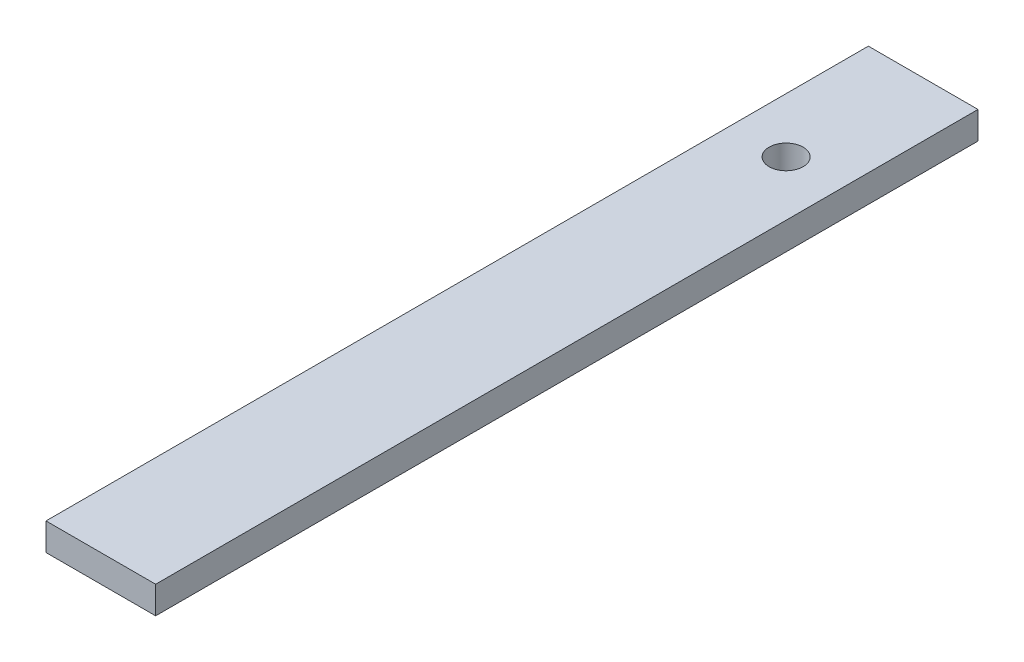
ISO-10303-21;
HEADER;
FILE_DESCRIPTION(('STEP AP214'),'2;1');
FILE_NAME('part.step','',(''),(''),'','','');
FILE_SCHEMA(('AUTOMOTIVE_DESIGN { 1 0 10303 214 1 1 1 1 }'));
ENDSEC;
DATA;
#1=APPLICATION_CONTEXT('core data for automotive mechanical design processes');
#2=APPLICATION_PROTOCOL_DEFINITION('international standard','automotive_design',2000,#1);
#3=PRODUCT_CONTEXT('',#1,'mechanical');
#4=PRODUCT('Part','Part','',(#3));
#5=PRODUCT_RELATED_PRODUCT_CATEGORY('part','',(#4));
#6=PRODUCT_DEFINITION_FORMATION('','',#4);
#7=PRODUCT_DEFINITION_CONTEXT('part definition',#1,'design');
#8=PRODUCT_DEFINITION('design','',#6,#7);
#9=PRODUCT_DEFINITION_SHAPE('','',#8);
#10=(LENGTH_UNIT() NAMED_UNIT(*) SI_UNIT(.MILLI.,.METRE.));
#11=(NAMED_UNIT(*) PLANE_ANGLE_UNIT() SI_UNIT($,.RADIAN.));
#12=(NAMED_UNIT(*) SI_UNIT($,.STERADIAN.) SOLID_ANGLE_UNIT());
#13=UNCERTAINTY_MEASURE_WITH_UNIT(LENGTH_MEASURE(1.E-05),#10,'distance_accuracy_value','');
#14=(GEOMETRIC_REPRESENTATION_CONTEXT(3) GLOBAL_UNCERTAINTY_ASSIGNED_CONTEXT((#13)) GLOBAL_UNIT_ASSIGNED_CONTEXT((#10,
#11,#12)) REPRESENTATION_CONTEXT('',''));
#15=CARTESIAN_POINT('',(0.,0.,0.));
#16=DIRECTION('',(0.,0.,1.));
#17=DIRECTION('',(1.,0.,0.));
#18=AXIS2_PLACEMENT_3D('',#15,#16,#17);
#19=CARTESIAN_POINT('',(0.,12.7,0.));
#20=DIRECTION('',(0.,-1.,0.));
#21=DIRECTION('',(0.,0.,-1.));
#22=AXIS2_PLACEMENT_3D('',#19,#20,#21);
#23=PLANE('',#22);
#24=DIRECTION('',(0.,0.,1.));
#25=VECTOR('',#24,1.);
#26=CARTESIAN_POINT('',(0.,12.7,0.));
#27=LINE('',#26,#25);
#28=CARTESIAN_POINT('',(0.,12.7,-381.));
#29=VERTEX_POINT('',#28);
#30=CARTESIAN_POINT('',(0.,12.7,0.));
#31=VERTEX_POINT('',#30);
#32=EDGE_CURVE('E85',#29,#31,#27,.T.);
#33=ORIENTED_EDGE('',*,*,#32,.T.);
#34=DIRECTION('',(1.,0.,0.));
#35=VECTOR('',#34,1.);
#36=CARTESIAN_POINT('',(0.,12.7,0.));
#37=LINE('',#36,#35);
#38=CARTESIAN_POINT('',(50.8,12.7,0.));
#39=VERTEX_POINT('',#38);
#40=EDGE_CURVE('E80',#31,#39,#37,.T.);
#41=ORIENTED_EDGE('',*,*,#40,.T.);
#42=DIRECTION('',(0.,0.,-1.));
#43=VECTOR('',#42,1.);
#44=CARTESIAN_POINT('',(50.8,12.7,0.));
#45=LINE('',#44,#43);
#46=CARTESIAN_POINT('',(50.7999999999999,12.7,-381.));
#47=VERTEX_POINT('',#46);
#48=EDGE_CURVE('E83',#39,#47,#45,.T.);
#49=ORIENTED_EDGE('',*,*,#48,.T.);
#50=DIRECTION('',(-1.,0.,0.));
#51=VECTOR('',#50,1.);
#52=CARTESIAN_POINT('',(0.,12.7,-381.));
#53=LINE('',#52,#51);
#54=EDGE_CURVE('E50',#47,#29,#53,.T.);
#55=ORIENTED_EDGE('',*,*,#54,.T.);
#56=EDGE_LOOP('',(#33,#41,#49,#55));
#57=FACE_BOUND('',#56,.T.);
#58=CARTESIAN_POINT('',(25.4,12.7,-317.5));
#59=DIRECTION('',(0.,1.,0.));
#60=DIRECTION('',(0.,0.,1.));
#61=AXIS2_PLACEMENT_3D('',#58,#59,#60);
#62=CIRCLE('',#61,7.87400000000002);
#63=CARTESIAN_POINT('',(25.4,12.7,-309.626));
#64=VERTEX_POINT('',#63);
#65=EDGE_CURVE('E100',#64,#64,#62,.T.);
#66=ORIENTED_EDGE('',*,*,#65,.F.);
#67=EDGE_LOOP('',(#66));
#68=FACE_BOUND('',#67,.T.);
#69=ADVANCED_FACE('F33',(#57,#68),#23,.F.);
#70=CARTESIAN_POINT('',(0.,0.,0.));
#71=DIRECTION('',(0.,-1.,0.));
#72=DIRECTION('',(0.,0.,-1.));
#73=AXIS2_PLACEMENT_3D('',#70,#71,#72);
#74=PLANE('',#73);
#75=DIRECTION('',(0.,0.,1.));
#76=VECTOR('',#75,1.);
#77=CARTESIAN_POINT('',(0.,0.,0.));
#78=LINE('',#77,#76);
#79=CARTESIAN_POINT('',(0.,0.,-381.));
#80=VERTEX_POINT('',#79);
#81=CARTESIAN_POINT('',(0.,0.,0.));
#82=VERTEX_POINT('',#81);
#83=EDGE_CURVE('E97',#80,#82,#78,.T.);
#84=ORIENTED_EDGE('',*,*,#83,.F.);
#85=DIRECTION('',(-1.,0.,0.));
#86=VECTOR('',#85,1.);
#87=CARTESIAN_POINT('',(0.,0.,-381.));
#88=LINE('',#87,#86);
#89=CARTESIAN_POINT('',(50.7999999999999,0.,-381.));
#90=VERTEX_POINT('',#89);
#91=EDGE_CURVE('E73',#90,#80,#88,.T.);
#92=ORIENTED_EDGE('',*,*,#91,.F.);
#93=DIRECTION('',(0.,0.,-1.));
#94=VECTOR('',#93,1.);
#95=CARTESIAN_POINT('',(50.8,0.,0.));
#96=LINE('',#95,#94);
#97=CARTESIAN_POINT('',(50.8,0.,0.));
#98=VERTEX_POINT('',#97);
#99=EDGE_CURVE('E67',#98,#90,#96,.T.);
#100=ORIENTED_EDGE('',*,*,#99,.F.);
#101=DIRECTION('',(1.,0.,0.));
#102=VECTOR('',#101,1.);
#103=CARTESIAN_POINT('',(0.,0.,0.));
#104=LINE('',#103,#102);
#105=EDGE_CURVE('E89',#82,#98,#104,.T.);
#106=ORIENTED_EDGE('',*,*,#105,.F.);
#107=EDGE_LOOP('',(#84,#92,#100,#106));
#108=FACE_BOUND('',#107,.T.);
#109=CARTESIAN_POINT('',(25.4,0.,-317.5));
#110=DIRECTION('',(0.,1.,0.));
#111=DIRECTION('',(0.,0.,1.));
#112=AXIS2_PLACEMENT_3D('',#109,#110,#111);
#113=CIRCLE('',#112,7.87400000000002);
#114=CARTESIAN_POINT('',(25.4,0.,-309.626));
#115=VERTEX_POINT('',#114);
#116=EDGE_CURVE('E112',#115,#115,#113,.T.);
#117=ORIENTED_EDGE('',*,*,#116,.T.);
#118=EDGE_LOOP('',(#117));
#119=FACE_BOUND('',#118,.T.);
#120=ADVANCED_FACE('F108',(#108,#119),#74,.T.);
#121=CARTESIAN_POINT('',(0.,12.7,0.));
#122=DIRECTION('',(1.,0.,0.));
#123=DIRECTION('',(0.,0.,-1.));
#124=AXIS2_PLACEMENT_3D('',#121,#122,#123);
#125=PLANE('',#124);
#126=ORIENTED_EDGE('',*,*,#83,.T.);
#127=DIRECTION('',(0.,-1.,0.));
#128=VECTOR('',#127,1.);
#129=CARTESIAN_POINT('',(0.,12.7,0.));
#130=LINE('',#129,#128);
#131=EDGE_CURVE('E11',#31,#82,#130,.T.);
#132=ORIENTED_EDGE('',*,*,#131,.F.);
#133=ORIENTED_EDGE('',*,*,#32,.F.);
#134=DIRECTION('',(0.,-1.,0.));
#135=VECTOR('',#134,1.);
#136=CARTESIAN_POINT('',(0.,12.7,-381.));
#137=LINE('',#136,#135);
#138=EDGE_CURVE('E93',#29,#80,#137,.T.);
#139=ORIENTED_EDGE('',*,*,#138,.T.);
#140=EDGE_LOOP('',(#126,#132,#133,#139));
#141=FACE_BOUND('',#140,.T.);
#142=ADVANCED_FACE('F35',(#141),#125,.F.);
#143=CARTESIAN_POINT('',(0.,12.7,0.));
#144=DIRECTION('',(0.,0.,-1.));
#145=DIRECTION('',(-1.,0.,0.));
#146=AXIS2_PLACEMENT_3D('',#143,#144,#145);
#147=PLANE('',#146);
#148=ORIENTED_EDGE('',*,*,#105,.T.);
#149=DIRECTION('',(0.,-1.,0.));
#150=VECTOR('',#149,1.);
#151=CARTESIAN_POINT('',(50.8,12.7,0.));
#152=LINE('',#151,#150);
#153=EDGE_CURVE('E42',#39,#98,#152,.T.);
#154=ORIENTED_EDGE('',*,*,#153,.F.);
#155=ORIENTED_EDGE('',*,*,#40,.F.);
#156=ORIENTED_EDGE('',*,*,#131,.T.);
#157=EDGE_LOOP('',(#148,#154,#155,#156));
#158=FACE_BOUND('',#157,.T.);
#159=ADVANCED_FACE('F88',(#158),#147,.F.);
#160=CARTESIAN_POINT('',(50.8,12.7,0.));
#161=DIRECTION('',(-1.,0.,0.));
#162=DIRECTION('',(0.,0.,1.));
#163=AXIS2_PLACEMENT_3D('',#160,#161,#162);
#164=PLANE('',#163);
#165=ORIENTED_EDGE('',*,*,#99,.T.);
#166=DIRECTION('',(0.,-1.,0.));
#167=VECTOR('',#166,1.);
#168=CARTESIAN_POINT('',(50.7999999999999,12.7,-381.));
#169=LINE('',#168,#167);
#170=EDGE_CURVE('E90',#47,#90,#169,.T.);
#171=ORIENTED_EDGE('',*,*,#170,.F.);
#172=ORIENTED_EDGE('',*,*,#48,.F.);
#173=ORIENTED_EDGE('',*,*,#153,.T.);
#174=EDGE_LOOP('',(#165,#171,#172,#173));
#175=FACE_BOUND('',#174,.T.);
#176=ADVANCED_FACE('F91',(#175),#164,.F.);
#177=CARTESIAN_POINT('',(0.,12.7,-381.));
#178=DIRECTION('',(0.,0.,1.));
#179=DIRECTION('',(1.,0.,0.));
#180=AXIS2_PLACEMENT_3D('',#177,#178,#179);
#181=PLANE('',#180);
#182=ORIENTED_EDGE('',*,*,#91,.T.);
#183=ORIENTED_EDGE('',*,*,#138,.F.);
#184=ORIENTED_EDGE('',*,*,#54,.F.);
#185=ORIENTED_EDGE('',*,*,#170,.T.);
#186=EDGE_LOOP('',(#182,#183,#184,#185));
#187=FACE_BOUND('',#186,.T.);
#188=ADVANCED_FACE('F105',(#187),#181,.F.);
#189=CARTESIAN_POINT('',(25.4,12.7,-317.5));
#190=DIRECTION('',(0.,-1.,0.));
#191=DIRECTION('',(0.,0.,-1.));
#192=AXIS2_PLACEMENT_3D('',#189,#190,#191);
#193=CYLINDRICAL_SURFACE('',#192,7.87400000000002);
#194=ORIENTED_EDGE('',*,*,#65,.T.);
#195=EDGE_LOOP('',(#194));
#196=FACE_BOUND('',#195,.T.);
#197=ORIENTED_EDGE('',*,*,#116,.F.);
#198=EDGE_LOOP('',(#197));
#199=FACE_BOUND('',#198,.T.);
#200=ADVANCED_FACE('F118',(#196,#199),#193,.F.);
#201=CLOSED_SHELL('',(#69,#120,#142,#159,#176,#188,#200));
#202=MANIFOLD_SOLID_BREP('B2',#201);
#203=ADVANCED_BREP_SHAPE_REPRESENTATION('',(#18,#202),#14);
#204=SHAPE_DEFINITION_REPRESENTATION(#9,#203);
ENDSEC;
END-ISO-10303-21;
